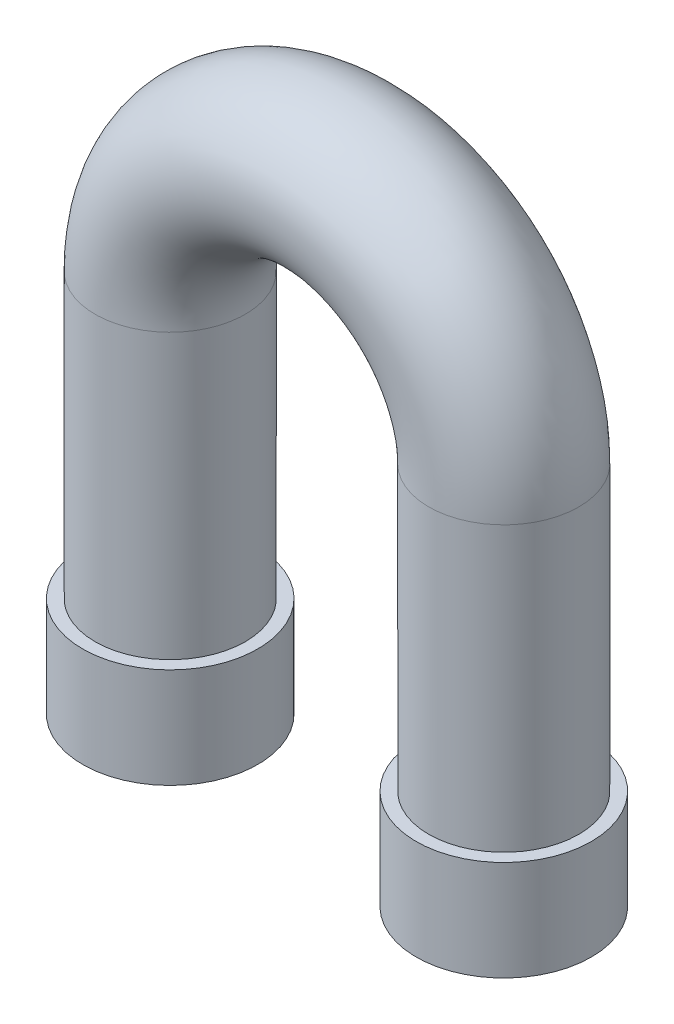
from build123d import *

# Parameters (mm, degrees)
SWEEP_THIN1_PROFILE_R   = 45
SWEEP_THIN1_PROFILE_R_2 = 35
BOSS_EXTRUDE1_START     = 60
SKETCH14_R              = 52.5
SKETCH14_R_2            = 35
BOSS_EXTRUDE1_DEPTH     = 60


with BuildPart() as part:
    # Sweep-Thin1: sweep along a path in Sketch1
    with BuildLine(Plane.XY) as sweep_thin1_path:
        Line((-100, -170), (-100, 0))
        ThreePointArc((-100, 0), (0, 100), (100, 0))
        Line((100, 0), (100, -170))
    # Sweep-Thin1 profile (on start of the path) → Sweep-Thin1 (sweep)
    with BuildSketch(Plane(origin=(-100, -170, 0), x_dir=(1, 0, 0), z_dir=(0, 1, 0))):
        Circle(SWEEP_THIN1_PROFILE_R)
        Circle(SWEEP_THIN1_PROFILE_R_2, mode=Mode.SUBTRACT)
    sweep(path=sweep_thin1_path.line)

    # Sketch14 → Boss-Extrude1 (add)
    with BuildSketch(Plane.XZ.offset(170).offset(BOSS_EXTRUDE1_START)):
        with Locations((100, 0)):
            Circle(SKETCH14_R)
        with Locations((100, 0)):
            Circle(SKETCH14_R_2, mode=Mode.SUBTRACT)
    boss_extrude1 = extrude(amount=-BOSS_EXTRUDE1_DEPTH)

    # Mirror1: Boss-Extrude1 across plane
    add(boss_extrude1.mirror(Plane(origin=(0, 0, 0), x_dir=(0, 0, 1), z_dir=(1, 0, 0))))


solid = part.part
